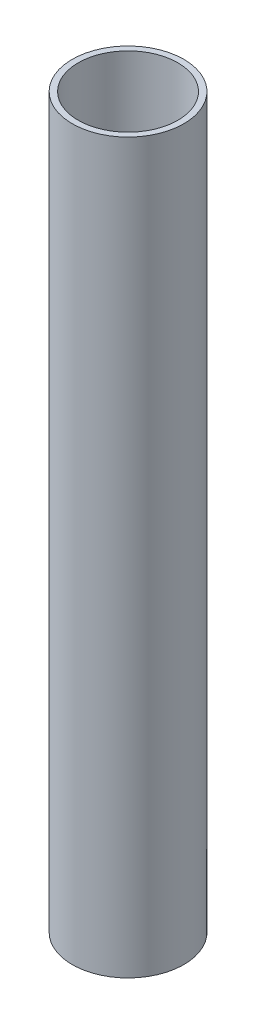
ISO-10303-21;
HEADER;
FILE_DESCRIPTION(('STEP AP214'),'2;1');
FILE_NAME('part.step','',(''),(''),'','','');
FILE_SCHEMA(('AUTOMOTIVE_DESIGN { 1 0 10303 214 1 1 1 1 }'));
ENDSEC;
DATA;
#1=APPLICATION_CONTEXT('core data for automotive mechanical design processes');
#2=APPLICATION_PROTOCOL_DEFINITION('international standard','automotive_design',2000,#1);
#3=PRODUCT_CONTEXT('',#1,'mechanical');
#4=PRODUCT('Part','Part','',(#3));
#5=PRODUCT_RELATED_PRODUCT_CATEGORY('part','',(#4));
#6=PRODUCT_DEFINITION_FORMATION('','',#4);
#7=PRODUCT_DEFINITION_CONTEXT('part definition',#1,'design');
#8=PRODUCT_DEFINITION('design','',#6,#7);
#9=PRODUCT_DEFINITION_SHAPE('','',#8);
#10=(LENGTH_UNIT() NAMED_UNIT(*) SI_UNIT(.MILLI.,.METRE.));
#11=(NAMED_UNIT(*) PLANE_ANGLE_UNIT() SI_UNIT($,.RADIAN.));
#12=(NAMED_UNIT(*) SI_UNIT($,.STERADIAN.) SOLID_ANGLE_UNIT());
#13=UNCERTAINTY_MEASURE_WITH_UNIT(LENGTH_MEASURE(1.E-05),#10,'distance_accuracy_value','');
#14=(GEOMETRIC_REPRESENTATION_CONTEXT(3) GLOBAL_UNCERTAINTY_ASSIGNED_CONTEXT((#13)) GLOBAL_UNIT_ASSIGNED_CONTEXT((#10,
#11,#12)) REPRESENTATION_CONTEXT('',''));
#15=CARTESIAN_POINT('',(0.,0.,0.));
#16=DIRECTION('',(0.,0.,1.));
#17=DIRECTION('',(1.,0.,0.));
#18=AXIS2_PLACEMENT_3D('',#15,#16,#17);
#19=CARTESIAN_POINT('',(0.,122.,0.));
#20=DIRECTION('',(0.,1.,0.));
#21=DIRECTION('',(0.,0.,1.));
#22=AXIS2_PLACEMENT_3D('',#19,#20,#21);
#23=PLANE('',#22);
#24=CARTESIAN_POINT('',(0.,122.,0.));
#25=DIRECTION('',(0.,1.,0.));
#26=DIRECTION('',(0.,0.,1.));
#27=AXIS2_PLACEMENT_3D('',#24,#25,#26);
#28=CIRCLE('',#27,9.35);
#29=CARTESIAN_POINT('',(0.,122.,-9.35));
#30=VERTEX_POINT('',#29);
#31=EDGE_CURVE('E10',#30,#30,#28,.T.);
#32=ORIENTED_EDGE('',*,*,#31,.T.);
#33=EDGE_LOOP('',(#32));
#34=FACE_BOUND('',#33,.T.);
#35=CARTESIAN_POINT('',(0.,122.,0.));
#36=DIRECTION('',(0.,1.,0.));
#37=DIRECTION('',(0.,0.,1.));
#38=AXIS2_PLACEMENT_3D('',#35,#36,#37);
#39=CIRCLE('',#38,8.35);
#40=CARTESIAN_POINT('',(0.,122.,-8.35));
#41=VERTEX_POINT('',#40);
#42=EDGE_CURVE('E56',#41,#41,#39,.T.);
#43=ORIENTED_EDGE('',*,*,#42,.F.);
#44=EDGE_LOOP('',(#43));
#45=FACE_BOUND('',#44,.T.);
#46=ADVANCED_FACE('F43',(#34,#45),#23,.T.);
#47=CARTESIAN_POINT('',(0.,0.,0.));
#48=DIRECTION('',(0.,1.,0.));
#49=DIRECTION('',(0.,0.,1.));
#50=AXIS2_PLACEMENT_3D('',#47,#48,#49);
#51=PLANE('',#50);
#52=CARTESIAN_POINT('',(0.,0.,0.));
#53=DIRECTION('',(0.,1.,0.));
#54=DIRECTION('',(0.,0.,1.));
#55=AXIS2_PLACEMENT_3D('',#52,#53,#54);
#56=CIRCLE('',#55,9.35);
#57=CARTESIAN_POINT('',(0.,0.,-9.35));
#58=VERTEX_POINT('',#57);
#59=EDGE_CURVE('E47',#58,#58,#56,.T.);
#60=ORIENTED_EDGE('',*,*,#59,.F.);
#61=EDGE_LOOP('',(#60));
#62=FACE_BOUND('',#61,.T.);
#63=CARTESIAN_POINT('',(0.,0.,0.));
#64=DIRECTION('',(0.,1.,0.));
#65=DIRECTION('',(0.,0.,1.));
#66=AXIS2_PLACEMENT_3D('',#63,#64,#65);
#67=CIRCLE('',#66,8.35);
#68=CARTESIAN_POINT('',(0.,0.,-8.35));
#69=VERTEX_POINT('',#68);
#70=EDGE_CURVE('E58',#69,#69,#67,.T.);
#71=ORIENTED_EDGE('',*,*,#70,.T.);
#72=EDGE_LOOP('',(#71));
#73=FACE_BOUND('',#72,.T.);
#74=ADVANCED_FACE('F70',(#62,#73),#51,.F.);
#75=CARTESIAN_POINT('',(0.,122.,0.));
#76=DIRECTION('',(0.,-1.,0.));
#77=DIRECTION('',(0.,0.,-1.));
#78=AXIS2_PLACEMENT_3D('',#75,#76,#77);
#79=CYLINDRICAL_SURFACE('',#78,9.35);
#80=CARTESIAN_POINT('',(0.,122.,-9.35));
#81=CARTESIAN_POINT('',(0.,120.729166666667,-9.35));
#82=CARTESIAN_POINT('',(0.,119.458333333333,-9.35));
#83=CARTESIAN_POINT('',(0.,116.916666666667,-9.35));
#84=CARTESIAN_POINT('',(0.,115.645833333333,-9.35));
#85=CARTESIAN_POINT('',(0.,113.104166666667,-9.35));
#86=CARTESIAN_POINT('',(0.,111.833333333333,-9.35));
#87=CARTESIAN_POINT('',(0.,109.291666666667,-9.35));
#88=CARTESIAN_POINT('',(0.,108.020833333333,-9.35));
#89=CARTESIAN_POINT('',(0.,105.479166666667,-9.35));
#90=CARTESIAN_POINT('',(0.,104.208333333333,-9.35));
#91=CARTESIAN_POINT('',(0.,101.666666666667,-9.35));
#92=CARTESIAN_POINT('',(0.,100.395833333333,-9.35));
#93=CARTESIAN_POINT('',(0.,97.8541666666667,-9.35));
#94=CARTESIAN_POINT('',(0.,96.5833333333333,-9.35));
#95=CARTESIAN_POINT('',(0.,94.0416666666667,-9.35));
#96=CARTESIAN_POINT('',(0.,92.7708333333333,-9.35));
#97=CARTESIAN_POINT('',(0.,90.2291666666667,-9.35));
#98=CARTESIAN_POINT('',(0.,88.9583333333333,-9.35));
#99=CARTESIAN_POINT('',(0.,86.4166666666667,-9.35));
#100=CARTESIAN_POINT('',(0.,85.1458333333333,-9.35));
#101=CARTESIAN_POINT('',(0.,82.6041666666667,-9.35));
#102=CARTESIAN_POINT('',(0.,81.3333333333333,-9.35));
#103=CARTESIAN_POINT('',(0.,78.7916666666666,-9.35));
#104=CARTESIAN_POINT('',(0.,77.5208333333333,-9.35));
#105=CARTESIAN_POINT('',(0.,74.9791666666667,-9.35));
#106=CARTESIAN_POINT('',(0.,73.7083333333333,-9.35));
#107=CARTESIAN_POINT('',(0.,71.1666666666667,-9.35));
#108=CARTESIAN_POINT('',(0.,69.8958333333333,-9.35));
#109=CARTESIAN_POINT('',(0.,67.3541666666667,-9.35));
#110=CARTESIAN_POINT('',(0.,66.0833333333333,-9.35));
#111=CARTESIAN_POINT('',(0.,63.5416666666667,-9.35));
#112=CARTESIAN_POINT('',(0.,62.2708333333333,-9.35));
#113=CARTESIAN_POINT('',(0.,59.7291666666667,-9.35));
#114=CARTESIAN_POINT('',(0.,58.4583333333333,-9.35));
#115=CARTESIAN_POINT('',(0.,55.9166666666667,-9.35));
#116=CARTESIAN_POINT('',(0.,54.6458333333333,-9.35));
#117=CARTESIAN_POINT('',(0.,52.1041666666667,-9.35));
#118=CARTESIAN_POINT('',(0.,50.8333333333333,-9.35));
#119=CARTESIAN_POINT('',(0.,48.2916666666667,-9.35));
#120=CARTESIAN_POINT('',(0.,47.0208333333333,-9.35));
#121=CARTESIAN_POINT('',(0.,44.4791666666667,-9.35));
#122=CARTESIAN_POINT('',(0.,43.2083333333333,-9.35));
#123=CARTESIAN_POINT('',(0.,40.6666666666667,-9.35));
#124=CARTESIAN_POINT('',(0.,39.3958333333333,-9.35));
#125=CARTESIAN_POINT('',(0.,36.8541666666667,-9.35));
#126=CARTESIAN_POINT('',(0.,35.5833333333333,-9.35));
#127=CARTESIAN_POINT('',(0.,33.0416666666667,-9.35));
#128=CARTESIAN_POINT('',(0.,31.7708333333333,-9.35));
#129=CARTESIAN_POINT('',(0.,29.2291666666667,-9.35));
#130=CARTESIAN_POINT('',(0.,27.9583333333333,-9.35));
#131=CARTESIAN_POINT('',(0.,25.4166666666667,-9.35));
#132=CARTESIAN_POINT('',(0.,24.1458333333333,-9.35));
#133=CARTESIAN_POINT('',(0.,21.6041666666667,-9.35));
#134=CARTESIAN_POINT('',(0.,20.3333333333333,-9.35));
#135=CARTESIAN_POINT('',(0.,17.7916666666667,-9.35));
#136=CARTESIAN_POINT('',(0.,16.5208333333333,-9.35));
#137=CARTESIAN_POINT('',(0.,13.9791666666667,-9.35));
#138=CARTESIAN_POINT('',(0.,12.7083333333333,-9.35));
#139=CARTESIAN_POINT('',(0.,10.1666666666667,-9.35));
#140=CARTESIAN_POINT('',(0.,8.89583333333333,-9.35));
#141=CARTESIAN_POINT('',(0.,6.35416666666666,-9.35));
#142=CARTESIAN_POINT('',(0.,5.08333333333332,-9.35));
#143=CARTESIAN_POINT('',(0.,2.54166666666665,-9.35));
#144=CARTESIAN_POINT('',(0.,1.27083333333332,-9.35));
#145=CARTESIAN_POINT('',(0.,0.,-9.35));
#146=B_SPLINE_CURVE_WITH_KNOTS('',3,(#80,#81,#82,#83,#84,#85,#86,#87,#88,#89,#90,#91,#92,#93,
#94,#95,#96,#97,#98,#99,#100,#101,#102,#103,#104,#105,#106,#107,#108,#109,#110,#111,#112,#113,
#114,#115,#116,#117,#118,#119,#120,#121,#122,#123,#124,#125,#126,#127,#128,#129,#130,#131,#132,
#133,#134,#135,#136,#137,#138,#139,#140,#141,#142,#143,#144,#145),.UNSPECIFIED.,.F.,.F.,(4,2,2,
2,2,2,2,2,2,2,2,2,2,2,2,2,2,2,2,2,2,2,2,2,2,2,2,2,2,2,2,2,4),(0.,3.81250000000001,
7.62500000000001,11.4375,15.25,19.0625,22.875,26.6875,30.5,34.3125,38.125,41.9375,45.75,49.5625,
53.375,57.1875,61.,64.8125,68.625,72.4375,76.25,80.0625,83.875,87.6875,91.5,95.3125,99.125,
102.9375,106.75,110.5625,114.375,118.1875,122.),.UNSPECIFIED.);
#147=EDGE_CURVE('BSEAM45',#30,#58,#146,.T.);
#148=ORIENTED_EDGE('',*,*,#31,.F.);
#149=ORIENTED_EDGE('',*,*,#59,.T.);
#150=ORIENTED_EDGE('',*,*,#147,.T.);
#151=ORIENTED_EDGE('',*,*,#147,.F.);
#152=EDGE_LOOP('',(#148,#150,#149,#151));
#153=FACE_BOUND('',#152,.T.);
#154=ADVANCED_FACE('F45',(#153),#79,.T.);
#155=CARTESIAN_POINT('',(0.,122.,0.));
#156=DIRECTION('',(0.,-1.,0.));
#157=DIRECTION('',(0.,0.,-1.));
#158=AXIS2_PLACEMENT_3D('',#155,#156,#157);
#159=CYLINDRICAL_SURFACE('',#158,8.35);
#160=CARTESIAN_POINT('',(0.,122.,-8.35));
#161=CARTESIAN_POINT('',(0.,120.729166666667,-8.35));
#162=CARTESIAN_POINT('',(0.,119.458333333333,-8.35));
#163=CARTESIAN_POINT('',(0.,116.916666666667,-8.35));
#164=CARTESIAN_POINT('',(0.,115.645833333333,-8.35));
#165=CARTESIAN_POINT('',(0.,113.104166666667,-8.35));
#166=CARTESIAN_POINT('',(0.,111.833333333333,-8.35));
#167=CARTESIAN_POINT('',(0.,109.291666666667,-8.35));
#168=CARTESIAN_POINT('',(0.,108.020833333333,-8.35));
#169=CARTESIAN_POINT('',(0.,105.479166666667,-8.35));
#170=CARTESIAN_POINT('',(0.,104.208333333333,-8.35));
#171=CARTESIAN_POINT('',(0.,101.666666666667,-8.35));
#172=CARTESIAN_POINT('',(0.,100.395833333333,-8.35));
#173=CARTESIAN_POINT('',(0.,97.8541666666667,-8.35));
#174=CARTESIAN_POINT('',(0.,96.5833333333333,-8.35));
#175=CARTESIAN_POINT('',(0.,94.0416666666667,-8.35));
#176=CARTESIAN_POINT('',(0.,92.7708333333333,-8.35));
#177=CARTESIAN_POINT('',(0.,90.2291666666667,-8.35));
#178=CARTESIAN_POINT('',(0.,88.9583333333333,-8.35));
#179=CARTESIAN_POINT('',(0.,86.4166666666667,-8.35));
#180=CARTESIAN_POINT('',(0.,85.1458333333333,-8.35));
#181=CARTESIAN_POINT('',(0.,82.6041666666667,-8.35));
#182=CARTESIAN_POINT('',(0.,81.3333333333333,-8.35));
#183=CARTESIAN_POINT('',(0.,78.7916666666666,-8.35));
#184=CARTESIAN_POINT('',(0.,77.5208333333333,-8.35));
#185=CARTESIAN_POINT('',(0.,74.9791666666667,-8.35));
#186=CARTESIAN_POINT('',(0.,73.7083333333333,-8.35));
#187=CARTESIAN_POINT('',(0.,71.1666666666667,-8.35));
#188=CARTESIAN_POINT('',(0.,69.8958333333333,-8.35));
#189=CARTESIAN_POINT('',(0.,67.3541666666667,-8.35));
#190=CARTESIAN_POINT('',(0.,66.0833333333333,-8.35));
#191=CARTESIAN_POINT('',(0.,63.5416666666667,-8.35));
#192=CARTESIAN_POINT('',(0.,62.2708333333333,-8.35));
#193=CARTESIAN_POINT('',(0.,59.7291666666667,-8.35));
#194=CARTESIAN_POINT('',(0.,58.4583333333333,-8.35));
#195=CARTESIAN_POINT('',(0.,55.9166666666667,-8.35));
#196=CARTESIAN_POINT('',(0.,54.6458333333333,-8.35));
#197=CARTESIAN_POINT('',(0.,52.1041666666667,-8.35));
#198=CARTESIAN_POINT('',(0.,50.8333333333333,-8.35));
#199=CARTESIAN_POINT('',(0.,48.2916666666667,-8.35));
#200=CARTESIAN_POINT('',(0.,47.0208333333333,-8.35));
#201=CARTESIAN_POINT('',(0.,44.4791666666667,-8.35));
#202=CARTESIAN_POINT('',(0.,43.2083333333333,-8.35));
#203=CARTESIAN_POINT('',(0.,40.6666666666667,-8.35));
#204=CARTESIAN_POINT('',(0.,39.3958333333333,-8.35));
#205=CARTESIAN_POINT('',(0.,36.8541666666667,-8.35));
#206=CARTESIAN_POINT('',(0.,35.5833333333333,-8.35));
#207=CARTESIAN_POINT('',(0.,33.0416666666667,-8.35));
#208=CARTESIAN_POINT('',(0.,31.7708333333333,-8.35));
#209=CARTESIAN_POINT('',(0.,29.2291666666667,-8.35));
#210=CARTESIAN_POINT('',(0.,27.9583333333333,-8.35));
#211=CARTESIAN_POINT('',(0.,25.4166666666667,-8.35));
#212=CARTESIAN_POINT('',(0.,24.1458333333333,-8.35));
#213=CARTESIAN_POINT('',(0.,21.6041666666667,-8.35));
#214=CARTESIAN_POINT('',(0.,20.3333333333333,-8.35));
#215=CARTESIAN_POINT('',(0.,17.7916666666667,-8.35));
#216=CARTESIAN_POINT('',(0.,16.5208333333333,-8.35));
#217=CARTESIAN_POINT('',(0.,13.9791666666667,-8.35));
#218=CARTESIAN_POINT('',(0.,12.7083333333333,-8.35));
#219=CARTESIAN_POINT('',(0.,10.1666666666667,-8.35));
#220=CARTESIAN_POINT('',(0.,8.89583333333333,-8.35));
#221=CARTESIAN_POINT('',(0.,6.35416666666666,-8.35));
#222=CARTESIAN_POINT('',(0.,5.08333333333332,-8.35));
#223=CARTESIAN_POINT('',(0.,2.54166666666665,-8.35));
#224=CARTESIAN_POINT('',(0.,1.27083333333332,-8.35));
#225=CARTESIAN_POINT('',(0.,0.,-8.35));
#226=B_SPLINE_CURVE_WITH_KNOTS('',3,(#160,#161,#162,#163,#164,#165,#166,#167,#168,#169,#170,
#171,#172,#173,#174,#175,#176,#177,#178,#179,#180,#181,#182,#183,#184,#185,#186,#187,#188,#189,
#190,#191,#192,#193,#194,#195,#196,#197,#198,#199,#200,#201,#202,#203,#204,#205,#206,#207,#208,
#209,#210,#211,#212,#213,#214,#215,#216,#217,#218,#219,#220,#221,#222,#223,#224,#225),
.UNSPECIFIED.,.F.,.F.,(4,2,2,2,2,2,2,2,2,2,2,2,2,2,2,2,2,2,2,2,2,2,2,2,2,2,2,2,2,2,2,2,4),(0.,
3.81250000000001,7.62500000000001,11.4375,15.25,19.0625,22.875,26.6875,30.5,34.3125,38.125,
41.9375,45.75,49.5625,53.375,57.1875,61.,64.8125,68.625,72.4375,76.25,80.0625,83.875,87.6875,
91.5,95.3125,99.125,102.9375,106.75,110.5625,114.375,118.1875,122.),.UNSPECIFIED.);
#227=EDGE_CURVE('BSEAM66',#41,#69,#226,.T.);
#228=ORIENTED_EDGE('',*,*,#42,.T.);
#229=ORIENTED_EDGE('',*,*,#70,.F.);
#230=ORIENTED_EDGE('',*,*,#227,.T.);
#231=ORIENTED_EDGE('',*,*,#227,.F.);
#232=EDGE_LOOP('',(#228,#230,#229,#231));
#233=FACE_BOUND('',#232,.T.);
#234=ADVANCED_FACE('F66',(#233),#159,.F.);
#235=CLOSED_SHELL('',(#46,#74,#154,#234));
#236=MANIFOLD_SOLID_BREP('B2',#235);
#237=ADVANCED_BREP_SHAPE_REPRESENTATION('',(#18,#236),#14);
#238=SHAPE_DEFINITION_REPRESENTATION(#9,#237);
ENDSEC;
END-ISO-10303-21;
